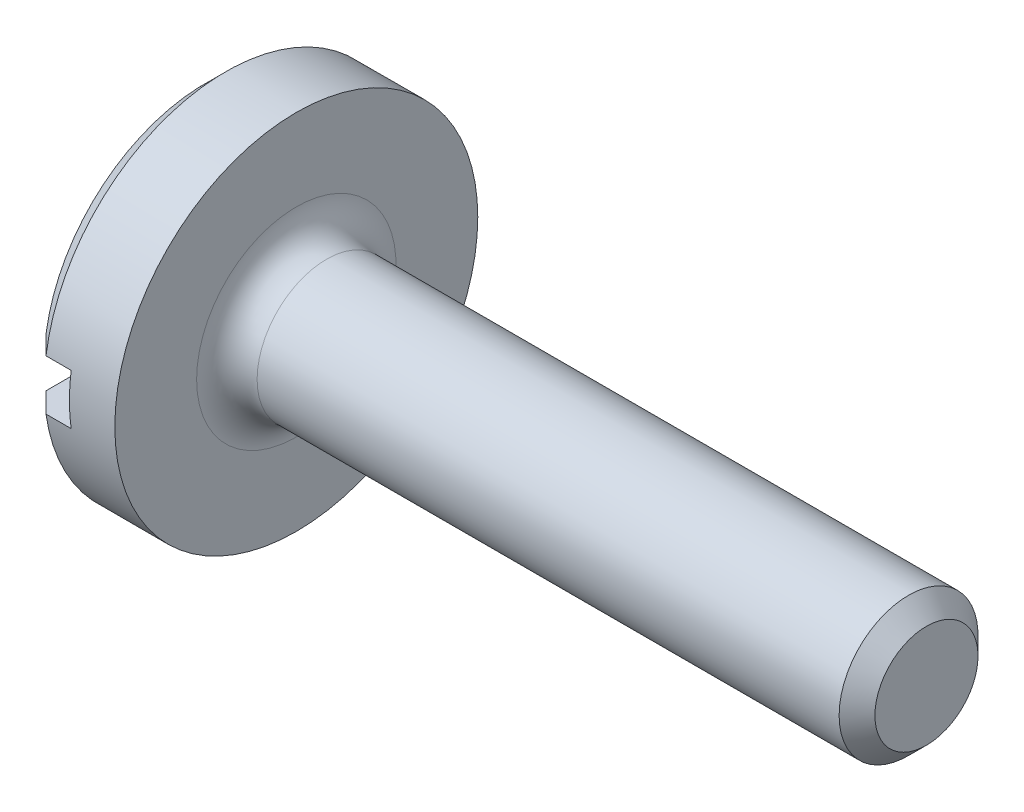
ISO-10303-21;
HEADER;
FILE_DESCRIPTION(('STEP AP214'),'2;1');
FILE_NAME('part.step','',(''),(''),'','','');
FILE_SCHEMA(('AUTOMOTIVE_DESIGN { 1 0 10303 214 1 1 1 1 }'));
ENDSEC;
DATA;
#1=APPLICATION_CONTEXT('core data for automotive mechanical design processes');
#2=APPLICATION_PROTOCOL_DEFINITION('international standard','automotive_design',2000,#1);
#3=PRODUCT_CONTEXT('',#1,'mechanical');
#4=PRODUCT('Part','Part','',(#3));
#5=PRODUCT_RELATED_PRODUCT_CATEGORY('part','',(#4));
#6=PRODUCT_DEFINITION_FORMATION('','',#4);
#7=PRODUCT_DEFINITION_CONTEXT('part definition',#1,'design');
#8=PRODUCT_DEFINITION('design','',#6,#7);
#9=PRODUCT_DEFINITION_SHAPE('','',#8);
#10=(LENGTH_UNIT() NAMED_UNIT(*) SI_UNIT(.MILLI.,.METRE.));
#11=(NAMED_UNIT(*) PLANE_ANGLE_UNIT() SI_UNIT($,.RADIAN.));
#12=(NAMED_UNIT(*) SI_UNIT($,.STERADIAN.) SOLID_ANGLE_UNIT());
#13=UNCERTAINTY_MEASURE_WITH_UNIT(LENGTH_MEASURE(1.E-05),#10,'distance_accuracy_value','');
#14=(GEOMETRIC_REPRESENTATION_CONTEXT(3) GLOBAL_UNCERTAINTY_ASSIGNED_CONTEXT((#13)) GLOBAL_UNIT_ASSIGNED_CONTEXT((#10,
#11,#12)) REPRESENTATION_CONTEXT('',''));
#15=CARTESIAN_POINT('',(0.,0.,0.));
#16=DIRECTION('',(0.,0.,1.));
#17=DIRECTION('',(1.,0.,0.));
#18=AXIS2_PLACEMENT_3D('',#15,#16,#17);
#19=CARTESIAN_POINT('',(-25.4,0.,0.));
#20=DIRECTION('',(-1.,0.,0.));
#21=DIRECTION('',(0.,0.,1.));
#22=AXIS2_PLACEMENT_3D('',#19,#20,#21);
#23=CYLINDRICAL_SURFACE('',#22,1.8288);
#24=CARTESIAN_POINT('',(0.914399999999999,0.,0.));
#25=DIRECTION('',(-1.,0.,0.));
#26=DIRECTION('',(0.,0.,1.));
#27=AXIS2_PLACEMENT_3D('',#24,#25,#26);
#28=CIRCLE('',#27,1.8288);
#29=CARTESIAN_POINT('',(0.914399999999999,0.,1.8288));
#30=VERTEX_POINT('',#29);
#31=EDGE_CURVE('E155',#30,#30,#28,.T.);
#32=ORIENTED_EDGE('',*,*,#31,.T.);
#33=EDGE_LOOP('',(#32));
#34=FACE_BOUND('',#33,.T.);
#35=CARTESIAN_POINT('',(0.203200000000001,0.,0.));
#36=DIRECTION('',(-1.,0.,0.));
#37=DIRECTION('',(0.,0.,1.));
#38=AXIS2_PLACEMENT_3D('',#35,#36,#37);
#39=CIRCLE('',#38,1.8288);
#40=CARTESIAN_POINT('',(0.20320000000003,-0.254,-1.81107521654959));
#41=VERTEX_POINT('',#40);
#42=CARTESIAN_POINT('',(0.203200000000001,-0.254,1.81107521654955));
#43=VERTEX_POINT('',#42);
#44=EDGE_CURVE('E156',#41,#43,#39,.T.);
#45=ORIENTED_EDGE('',*,*,#44,.F.);
#46=DIRECTION('',(-1.,0.,0.));
#47=VECTOR('',#46,1.);
#48=CARTESIAN_POINT('',(-25.4,-0.254,-1.81107521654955));
#49=LINE('',#48,#47);
#50=CARTESIAN_POINT('',(0.457200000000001,-0.254,-1.81107521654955));
#51=VERTEX_POINT('',#50);
#52=EDGE_CURVE('E62',#41,#51,#49,.F.);
#53=ORIENTED_EDGE('',*,*,#52,.T.);
#54=CARTESIAN_POINT('',(0.457200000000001,0.,0.));
#55=DIRECTION('',(-1.,0.,0.));
#56=DIRECTION('',(0.,0.,1.));
#57=AXIS2_PLACEMENT_3D('',#54,#55,#56);
#58=CIRCLE('',#57,1.8288);
#59=CARTESIAN_POINT('',(0.457200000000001,0.254,-1.81107521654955));
#60=VERTEX_POINT('',#59);
#61=EDGE_CURVE('E103',#51,#60,#58,.F.);
#62=ORIENTED_EDGE('',*,*,#61,.T.);
#63=DIRECTION('',(-1.,0.,0.));
#64=VECTOR('',#63,1.);
#65=CARTESIAN_POINT('',(-25.4,0.254,-1.81107521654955));
#66=LINE('',#65,#64);
#67=CARTESIAN_POINT('',(0.203200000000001,0.254,-1.81107521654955));
#68=VERTEX_POINT('',#67);
#69=EDGE_CURVE('E109',#60,#68,#66,.T.);
#70=ORIENTED_EDGE('',*,*,#69,.T.);
#71=CARTESIAN_POINT('',(0.20320000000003,0.254,1.81107521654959));
#72=VERTEX_POINT('',#71);
#73=EDGE_CURVE('E114',#72,#68,#39,.T.);
#74=ORIENTED_EDGE('',*,*,#73,.F.);
#75=DIRECTION('',(-1.,0.,0.));
#76=VECTOR('',#75,1.);
#77=CARTESIAN_POINT('',(-25.4,0.254,1.81107521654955));
#78=LINE('',#77,#76);
#79=CARTESIAN_POINT('',(0.457200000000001,0.254,1.81107521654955));
#80=VERTEX_POINT('',#79);
#81=EDGE_CURVE('E107',#72,#80,#78,.F.);
#82=ORIENTED_EDGE('',*,*,#81,.T.);
#83=CARTESIAN_POINT('',(0.457200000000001,-0.254,1.81107521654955));
#84=VERTEX_POINT('',#83);
#85=EDGE_CURVE('E93',#80,#84,#58,.F.);
#86=ORIENTED_EDGE('',*,*,#85,.T.);
#87=DIRECTION('',(-1.,0.,0.));
#88=VECTOR('',#87,1.);
#89=CARTESIAN_POINT('',(-25.4,-0.254,1.81107521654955));
#90=LINE('',#89,#88);
#91=EDGE_CURVE('E117',#84,#43,#90,.T.);
#92=ORIENTED_EDGE('',*,*,#91,.T.);
#93=EDGE_LOOP('',(#45,#53,#62,#70,#74,#82,#86,#92));
#94=FACE_BOUND('',#93,.T.);
#95=ADVANCED_FACE('F39',(#34,#94),#23,.T.);
#96=CARTESIAN_POINT('',(0.203200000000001,0.,0.));
#97=DIRECTION('',(1.,0.,0.));
#98=DIRECTION('',(0.,0.,-1.));
#99=AXIS2_PLACEMENT_3D('',#96,#97,#98);
#100=CONICAL_SURFACE('',#99,1.8288,0.785398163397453);
#101=CARTESIAN_POINT('',(2.40134405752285,-0.254,-4.01892553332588));
#102=CARTESIAN_POINT('',(2.26411243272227,-0.254,-3.88141790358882));
#103=CARTESIAN_POINT('',(2.12689277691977,-0.254,-3.74389831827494));
#104=CARTESIAN_POINT('',(1.85249047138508,-0.254,-3.46881754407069));
#105=CARTESIAN_POINT('',(1.71530782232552,-0.254,-3.33125635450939));
#106=CARTESIAN_POINT('',(1.44094420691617,-0.254,-3.05602612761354));
#107=CARTESIAN_POINT('',(1.303763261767,-0.254,-2.91835706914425));
#108=CARTESIAN_POINT('',(1.02948630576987,-0.254,-2.64293891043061));
#109=CARTESIAN_POINT('',(0.892390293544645,-0.254,-2.50518981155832));
#110=CARTESIAN_POINT('',(0.615134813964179,-0.254,-2.22634278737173));
#111=CARTESIAN_POINT('',(0.474978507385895,-0.254,-2.08524171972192));
#112=CARTESIAN_POINT('',(0.194901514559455,-0.254,-1.80279178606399));
#113=CARTESIAN_POINT('',(0.0549808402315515,-0.254,-1.66144290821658));
#114=CARTESIAN_POINT('',(-0.154496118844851,-0.254,-1.44905542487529));
#115=CARTESIAN_POINT('',(-0.22424585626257,-0.254,-1.37820765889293));
#116=CARTESIAN_POINT('',(-0.363542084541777,-0.254,-1.23630946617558));
#117=CARTESIAN_POINT('',(-0.433088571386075,-0.254,-1.16525903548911));
#118=CARTESIAN_POINT('',(-0.571828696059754,-0.254,-1.02282736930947));
#119=CARTESIAN_POINT('',(-0.641022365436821,-0.254,-0.951446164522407));
#120=CARTESIAN_POINT('',(-0.778783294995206,-0.254,-0.808082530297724));
#121=CARTESIAN_POINT('',(-0.847350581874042,-0.254,-0.736100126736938));
#122=CARTESIAN_POINT('',(-0.933516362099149,-0.254,-0.643824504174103));
#123=CARTESIAN_POINT('',(-0.951783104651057,-0.254,-0.624157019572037));
#124=CARTESIAN_POINT('',(-0.988170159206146,-0.254,-0.584687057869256));
#125=CARTESIAN_POINT('',(-1.00629046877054,-0.254,-0.56488457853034));
#126=CARTESIAN_POINT('',(-1.0603112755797,-0.254,-0.505296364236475));
#127=CARTESIAN_POINT('',(-1.09593883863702,-0.254,-0.465258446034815));
#128=CARTESIAN_POINT('',(-1.15457051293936,-0.254,-0.396927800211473));
#129=CARTESIAN_POINT('',(-1.17796824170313,-0.254,-0.368973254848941));
#130=CARTESIAN_POINT('',(-1.22365520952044,-0.254,-0.311993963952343));
#131=CARTESIAN_POINT('',(-1.24594060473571,-0.254,-0.282966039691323));
#132=CARTESIAN_POINT('',(-1.2848511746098,-0.254,-0.227850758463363));
#133=CARTESIAN_POINT('',(-1.30181803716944,-0.254,-0.20200616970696));
#134=CARTESIAN_POINT('',(-1.33229183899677,-0.254,-0.148331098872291));
#135=CARTESIAN_POINT('',(-1.34581753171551,-0.254,-0.120512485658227));
#136=CARTESIAN_POINT('',(-1.36086272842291,-0.254,-0.0759914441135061));
#137=CARTESIAN_POINT('',(-1.36503616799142,-0.254,-0.0602332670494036));
#138=CARTESIAN_POINT('',(-1.37051425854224,-0.254,-0.0282568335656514));
#139=CARTESIAN_POINT('',(-1.37183026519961,-0.254,-0.0120406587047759));
#140=CARTESIAN_POINT('',(-1.37130128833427,-0.254,0.020380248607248));
#141=CARTESIAN_POINT('',(-1.36944767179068,-0.254,0.0365848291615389));
#142=CARTESIAN_POINT('',(-1.36300429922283,-0.254,0.0684653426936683));
#143=CARTESIAN_POINT('',(-1.35840438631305,-0.254,0.0841390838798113));
#144=CARTESIAN_POINT('',(-1.34646501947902,-0.254,0.11690192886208));
#145=CARTESIAN_POINT('',(-1.33883071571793,-0.254,0.13387893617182));
#146=CARTESIAN_POINT('',(-1.32194163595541,-0.254,0.167021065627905));
#147=CARTESIAN_POINT('',(-1.31268339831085,-0.254,0.183184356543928));
#148=CARTESIAN_POINT('',(-1.29305944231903,-0.254,0.215000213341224));
#149=CARTESIAN_POINT('',(-1.28268509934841,-0.254,0.230647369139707));
#150=CARTESIAN_POINT('',(-1.26125731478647,-0.254,0.26143930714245));
#151=CARTESIAN_POINT('',(-1.25020459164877,-0.254,0.276584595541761));
#152=CARTESIAN_POINT('',(-1.21381853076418,-0.254,0.324861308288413));
#153=CARTESIAN_POINT('',(-1.18757520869,-0.254,0.357301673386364));
#154=CARTESIAN_POINT('',(-1.13398609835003,-0.254,0.421263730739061));
#155=CARTESIAN_POINT('',(-1.10663971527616,-0.254,0.452784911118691));
#156=CARTESIAN_POINT('',(-1.05126968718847,-0.254,0.51531649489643));
#157=CARTESIAN_POINT('',(-1.02324503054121,-0.254,0.546326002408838));
#158=CARTESIAN_POINT('',(-0.966812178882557,-0.254,0.607977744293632));
#159=CARTESIAN_POINT('',(-0.938404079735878,-0.254,0.638620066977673));
#160=CARTESIAN_POINT('',(-0.853090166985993,-0.254,0.72988285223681));
#161=CARTESIAN_POINT('',(-0.795810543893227,-0.254,0.790153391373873));
#162=CARTESIAN_POINT('',(-0.680808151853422,-0.254,0.910162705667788));
#163=CARTESIAN_POINT('',(-0.623085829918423,-0.254,0.969901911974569));
#164=CARTESIAN_POINT('',(-0.443292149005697,-0.254,1.15510727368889));
#165=CARTESIAN_POINT('',(-0.320740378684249,-0.254,1.28010671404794));
#166=CARTESIAN_POINT('',(-0.0751604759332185,-0.254,1.52963868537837));
#167=CARTESIAN_POINT('',(0.0478676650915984,-0.254,1.65417120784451));
#168=CARTESIAN_POINT('',(0.294233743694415,-0.254,1.90303992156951));
#169=CARTESIAN_POINT('',(0.417571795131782,-0.254,2.02737600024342));
#170=CARTESIAN_POINT('',(0.664390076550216,-0.254,2.27590505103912));
#171=CARTESIAN_POINT('',(0.787870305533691,-0.254,2.40009802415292));
#172=CARTESIAN_POINT('',(1.15954500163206,-0.254,2.77365393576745));
#173=CARTESIAN_POINT('',(1.40787267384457,-0.254000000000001,3.02288435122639));
#174=CARTESIAN_POINT('',(1.78042320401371,-0.254000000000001,3.39655135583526));
#175=CARTESIAN_POINT('',(1.90458661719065,-0.254000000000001,3.52104726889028));
#176=CARTESIAN_POINT('',(2.15294426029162,-0.254000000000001,3.77000773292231));
#177=CARTESIAN_POINT('',(2.27713849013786,-0.254000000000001,3.89447228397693));
#178=CARTESIAN_POINT('',(2.40134405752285,-0.254000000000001,4.01892553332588));
#179=B_SPLINE_CURVE_WITH_KNOTS('',3,(#101,#102,#103,#104,#105,#106,#107,#108,#109,#110,#111,
#112,#113,#114,#115,#116,#117,#118,#119,#120,#121,#122,#123,#124,#125,#126,#127,#128,#129,#130,
#131,#132,#133,#134,#135,#136,#137,#138,#139,#140,#141,#142,#143,#144,#145,#146,#147,#148,#149,
#150,#151,#152,#153,#154,#155,#156,#157,#158,#159,#160,#161,#162,#163,#164,#165,#166,#167,#168,
#169,#170,#171,#172,#173,#174,#175,#176,#177,#178),.UNSPECIFIED.,.F.,.F.,(4,2,2,2,2,2,2,2,2,2,2,
2,2,2,2,2,2,2,2,2,2,2,2,2,2,2,2,2,2,2,2,2,2,2,2,2,2,2,4),(0.,0.58281027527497,1.16563051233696,
1.74867632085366,2.33171241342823,2.92835272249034,3.52502235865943,3.82328364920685,
4.12155079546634,4.41979078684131,4.71801800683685,4.79854261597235,4.87906856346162,
5.03982632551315,5.1491791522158,5.25888686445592,5.35156888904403,5.44373444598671,
5.49243715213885,5.54094595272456,5.58958708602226,5.63840923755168,5.69411617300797,
5.7499433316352,5.80623797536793,5.8624739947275,5.98758936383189,6.1127731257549,
6.23815676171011,6.3635096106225,6.61294438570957,6.86215385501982,7.38730971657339,
7.91247509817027,8.43787512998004,8.96327149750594,10.0187530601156,10.5462396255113,
11.0737248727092),.UNSPECIFIED.);
#180=CARTESIAN_POINT('',(0.,-0.254,-1.60563363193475));
#181=VERTEX_POINT('',#180);
#182=EDGE_CURVE('E119',#41,#181,#179,.T.);
#183=ORIENTED_EDGE('',*,*,#182,.F.);
#184=ORIENTED_EDGE('',*,*,#44,.T.);
#185=CARTESIAN_POINT('',(0.,-0.254,1.60563363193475));
#186=VERTEX_POINT('',#185);
#187=EDGE_CURVE('E115',#186,#43,#179,.T.);
#188=ORIENTED_EDGE('',*,*,#187,.F.);
#189=CARTESIAN_POINT('',(0.,0.,0.));
#190=DIRECTION('',(-1.,0.,0.));
#191=DIRECTION('',(0.,0.,1.));
#192=AXIS2_PLACEMENT_3D('',#189,#190,#191);
#193=CIRCLE('',#192,1.6256);
#194=EDGE_CURVE('E207',#181,#186,#193,.T.);
#195=ORIENTED_EDGE('',*,*,#194,.F.);
#196=EDGE_LOOP('',(#183,#184,#188,#195));
#197=FACE_BOUND('',#196,.T.);
#198=ADVANCED_FACE('F131',(#197),#100,.T.);
#199=CARTESIAN_POINT('',(2.40134405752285,0.254,4.01892553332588));
#200=CARTESIAN_POINT('',(2.26411243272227,0.254,3.88141790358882));
#201=CARTESIAN_POINT('',(2.12689277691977,0.254,3.74389831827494));
#202=CARTESIAN_POINT('',(1.85249047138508,0.254,3.46881754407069));
#203=CARTESIAN_POINT('',(1.71530782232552,0.254,3.33125635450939));
#204=CARTESIAN_POINT('',(1.44094420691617,0.254,3.05602612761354));
#205=CARTESIAN_POINT('',(1.303763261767,0.254,2.91835706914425));
#206=CARTESIAN_POINT('',(1.02948630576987,0.254,2.64293891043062));
#207=CARTESIAN_POINT('',(0.892390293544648,0.254,2.50518981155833));
#208=CARTESIAN_POINT('',(0.615134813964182,0.254,2.22634278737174));
#209=CARTESIAN_POINT('',(0.474978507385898,0.254,2.08524171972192));
#210=CARTESIAN_POINT('',(0.194901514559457,0.254,1.802791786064));
#211=CARTESIAN_POINT('',(0.0549808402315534,0.254,1.66144290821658));
#212=CARTESIAN_POINT('',(-0.154496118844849,0.254,1.44905542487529));
#213=CARTESIAN_POINT('',(-0.224245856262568,0.254,1.37820765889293));
#214=CARTESIAN_POINT('',(-0.363542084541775,0.254,1.23630946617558));
#215=CARTESIAN_POINT('',(-0.433088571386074,0.254,1.16525903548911));
#216=CARTESIAN_POINT('',(-0.571828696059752,0.254,1.02282736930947));
#217=CARTESIAN_POINT('',(-0.641022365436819,0.254,0.951446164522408));
#218=CARTESIAN_POINT('',(-0.778783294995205,0.254,0.808082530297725));
#219=CARTESIAN_POINT('',(-0.847350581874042,0.254,0.73610012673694));
#220=CARTESIAN_POINT('',(-0.933516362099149,0.254,0.643824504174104));
#221=CARTESIAN_POINT('',(-0.951783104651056,0.254,0.624157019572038));
#222=CARTESIAN_POINT('',(-0.988170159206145,0.254,0.584687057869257));
#223=CARTESIAN_POINT('',(-1.00629046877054,0.254,0.564884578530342));
#224=CARTESIAN_POINT('',(-1.0603112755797,0.254,0.505296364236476));
#225=CARTESIAN_POINT('',(-1.09593883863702,0.254,0.465258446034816));
#226=CARTESIAN_POINT('',(-1.15457051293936,0.254,0.396927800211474));
#227=CARTESIAN_POINT('',(-1.17796824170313,0.254,0.368973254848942));
#228=CARTESIAN_POINT('',(-1.22365520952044,0.254,0.311993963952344));
#229=CARTESIAN_POINT('',(-1.24594060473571,0.254,0.282966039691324));
#230=CARTESIAN_POINT('',(-1.2848511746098,0.254,0.227850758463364));
#231=CARTESIAN_POINT('',(-1.30181803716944,0.254,0.202006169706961));
#232=CARTESIAN_POINT('',(-1.33229183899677,0.254,0.148331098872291));
#233=CARTESIAN_POINT('',(-1.34581753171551,0.254,0.120512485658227));
#234=CARTESIAN_POINT('',(-1.36086272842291,0.254,0.0759914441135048));
#235=CARTESIAN_POINT('',(-1.36503616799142,0.254,0.0602332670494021));
#236=CARTESIAN_POINT('',(-1.37051425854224,0.254,0.0282568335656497));
#237=CARTESIAN_POINT('',(-1.37183026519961,0.254,0.0120406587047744));
#238=CARTESIAN_POINT('',(-1.37130128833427,0.254,-0.0203802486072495));
#239=CARTESIAN_POINT('',(-1.36944767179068,0.254,-0.0365848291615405));
#240=CARTESIAN_POINT('',(-1.36300429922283,0.254,-0.0684653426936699));
#241=CARTESIAN_POINT('',(-1.35840438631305,0.254,-0.084139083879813));
#242=CARTESIAN_POINT('',(-1.34646501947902,0.254,-0.116901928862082));
#243=CARTESIAN_POINT('',(-1.33883071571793,0.254,-0.133878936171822));
#244=CARTESIAN_POINT('',(-1.32194163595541,0.254,-0.167021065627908));
#245=CARTESIAN_POINT('',(-1.31268339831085,0.254,-0.183184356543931));
#246=CARTESIAN_POINT('',(-1.29305944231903,0.254,-0.215000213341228));
#247=CARTESIAN_POINT('',(-1.2826850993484,0.254,-0.230647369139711));
#248=CARTESIAN_POINT('',(-1.26125731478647,0.254,-0.261439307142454));
#249=CARTESIAN_POINT('',(-1.25020459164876,0.254,-0.276584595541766));
#250=CARTESIAN_POINT('',(-1.21381853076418,0.254,-0.324861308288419));
#251=CARTESIAN_POINT('',(-1.18757520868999,0.254,-0.35730167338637));
#252=CARTESIAN_POINT('',(-1.13398609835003,0.254,-0.421263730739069));
#253=CARTESIAN_POINT('',(-1.10663971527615,0.254,-0.452784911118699));
#254=CARTESIAN_POINT('',(-1.05126968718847,0.254,-0.51531649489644));
#255=CARTESIAN_POINT('',(-1.0232450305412,0.254,-0.546326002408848));
#256=CARTESIAN_POINT('',(-0.966812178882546,0.254,-0.607977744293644));
#257=CARTESIAN_POINT('',(-0.938404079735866,0.254,-0.638620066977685));
#258=CARTESIAN_POINT('',(-0.853090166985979,0.254,-0.729882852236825));
#259=CARTESIAN_POINT('',(-0.795810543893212,0.254,-0.790153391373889));
#260=CARTESIAN_POINT('',(-0.680808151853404,0.254,-0.910162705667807));
#261=CARTESIAN_POINT('',(-0.623085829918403,0.254,-0.96990191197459));
#262=CARTESIAN_POINT('',(-0.443292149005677,0.254,-1.15510727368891));
#263=CARTESIAN_POINT('',(-0.32074037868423,0.254,-1.28010671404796));
#264=CARTESIAN_POINT('',(-0.0751604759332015,0.254,-1.52963868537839));
#265=CARTESIAN_POINT('',(0.0478676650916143,0.254,-1.65417120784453));
#266=CARTESIAN_POINT('',(0.294233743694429,0.254,-1.90303992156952));
#267=CARTESIAN_POINT('',(0.417571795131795,0.254,-2.02737600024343));
#268=CARTESIAN_POINT('',(0.664390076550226,0.254,-2.27590505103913));
#269=CARTESIAN_POINT('',(0.7878703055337,0.254,-2.40009802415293));
#270=CARTESIAN_POINT('',(1.15954500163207,0.254,-2.77365393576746));
#271=CARTESIAN_POINT('',(1.40787267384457,0.254,-3.0228843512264));
#272=CARTESIAN_POINT('',(1.78042320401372,0.254,-3.39655135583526));
#273=CARTESIAN_POINT('',(1.90458661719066,0.254,-3.52104726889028));
#274=CARTESIAN_POINT('',(2.15294426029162,0.254,-3.77000773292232));
#275=CARTESIAN_POINT('',(2.27713849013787,0.254,-3.89447228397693));
#276=CARTESIAN_POINT('',(2.40134405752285,0.254,-4.01892553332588));
#277=B_SPLINE_CURVE_WITH_KNOTS('',3,(#199,#200,#201,#202,#203,#204,#205,#206,#207,#208,#209,
#210,#211,#212,#213,#214,#215,#216,#217,#218,#219,#220,#221,#222,#223,#224,#225,#226,#227,#228,
#229,#230,#231,#232,#233,#234,#235,#236,#237,#238,#239,#240,#241,#242,#243,#244,#245,#246,#247,
#248,#249,#250,#251,#252,#253,#254,#255,#256,#257,#258,#259,#260,#261,#262,#263,#264,#265,#266,
#267,#268,#269,#270,#271,#272,#273,#274,#275,#276),.UNSPECIFIED.,.F.,.F.,(4,2,2,2,2,2,2,2,2,2,2,
2,2,2,2,2,2,2,2,2,2,2,2,2,2,2,2,2,2,2,2,2,2,2,2,2,2,2,4),(0.,0.582810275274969,1.16563051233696,
1.74867632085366,2.33171241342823,2.92835272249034,3.52502235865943,3.82328364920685,
4.12155079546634,4.41979078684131,4.71801800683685,4.79854261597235,4.87906856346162,
5.03982632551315,5.1491791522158,5.25888686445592,5.35156888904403,5.44373444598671,
5.49243715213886,5.54094595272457,5.58958708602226,5.63840923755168,5.69411617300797,
5.74994333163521,5.80623797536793,5.8624739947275,5.9875893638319,6.11277312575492,
6.23815676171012,6.36350961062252,6.6129443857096,6.86215385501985,7.38730971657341,
7.9124750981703,8.43787512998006,8.96327149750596,10.0187530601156,10.5462396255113,
11.0737248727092),.UNSPECIFIED.);
#278=CARTESIAN_POINT('',(0.,0.254,1.60563363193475));
#279=VERTEX_POINT('',#278);
#280=EDGE_CURVE('E54',#72,#279,#277,.T.);
#281=ORIENTED_EDGE('',*,*,#280,.F.);
#282=ORIENTED_EDGE('',*,*,#73,.T.);
#283=CARTESIAN_POINT('',(0.,0.254,-1.60563363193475));
#284=VERTEX_POINT('',#283);
#285=EDGE_CURVE('E121',#284,#68,#277,.T.);
#286=ORIENTED_EDGE('',*,*,#285,.F.);
#287=EDGE_CURVE('E162',#279,#284,#193,.T.);
#288=ORIENTED_EDGE('',*,*,#287,.F.);
#289=EDGE_LOOP('',(#281,#282,#286,#288));
#290=FACE_BOUND('',#289,.T.);
#291=ADVANCED_FACE('F152',(#290),#100,.T.);
#292=CARTESIAN_POINT('',(0.,0.,0.));
#293=DIRECTION('',(-1.,0.,0.));
#294=DIRECTION('',(0.,0.,1.));
#295=AXIS2_PLACEMENT_3D('',#292,#293,#294);
#296=PLANE('',#295);
#297=ORIENTED_EDGE('',*,*,#194,.T.);
#298=DIRECTION('',(0.,0.,-1.));
#299=VECTOR('',#298,1.);
#300=CARTESIAN_POINT('',(0.,-0.254,0.));
#301=LINE('',#300,#299);
#302=EDGE_CURVE('E104',#186,#181,#301,.T.);
#303=ORIENTED_EDGE('',*,*,#302,.T.);
#304=EDGE_LOOP('',(#297,#303));
#305=FACE_BOUND('',#304,.T.);
#306=ADVANCED_FACE('F197',(#305),#296,.T.);
#307=ORIENTED_EDGE('',*,*,#287,.T.);
#308=DIRECTION('',(0.,0.,1.));
#309=VECTOR('',#308,1.);
#310=CARTESIAN_POINT('',(0.,0.254,0.));
#311=LINE('',#310,#309);
#312=EDGE_CURVE('E159',#284,#279,#311,.T.);
#313=ORIENTED_EDGE('',*,*,#312,.T.);
#314=EDGE_LOOP('',(#307,#313));
#315=FACE_BOUND('',#314,.T.);
#316=ADVANCED_FACE('F192',(#315),#296,.T.);
#317=CARTESIAN_POINT('',(-25.4,0.,0.));
#318=DIRECTION('',(-1.,0.,0.));
#319=DIRECTION('',(0.,0.,1.));
#320=AXIS2_PLACEMENT_3D('',#317,#318,#319);
#321=CYLINDRICAL_SURFACE('',#320,0.69977);
#322=CARTESIAN_POINT('',(1.2192,0.,0.));
#323=DIRECTION('',(-1.,0.,0.));
#324=DIRECTION('',(0.,0.,1.));
#325=AXIS2_PLACEMENT_3D('',#322,#323,#324);
#326=CIRCLE('',#325,0.69977);
#327=CARTESIAN_POINT('',(1.2192,0.,0.69977));
#328=VERTEX_POINT('',#327);
#329=EDGE_CURVE('E11',#328,#328,#326,.F.);
#330=ORIENTED_EDGE('',*,*,#329,.T.);
#331=EDGE_LOOP('',(#330));
#332=FACE_BOUND('',#331,.T.);
#333=CARTESIAN_POINT('',(7.08406,0.,0.));
#334=DIRECTION('',(-1.,0.,0.));
#335=DIRECTION('',(0.,0.,1.));
#336=AXIS2_PLACEMENT_3D('',#333,#334,#335);
#337=CIRCLE('',#336,0.69977);
#338=CARTESIAN_POINT('',(7.08406,0.,0.69977));
#339=VERTEX_POINT('',#338);
#340=EDGE_CURVE('E202',#339,#339,#337,.T.);
#341=ORIENTED_EDGE('',*,*,#340,.T.);
#342=EDGE_LOOP('',(#341));
#343=FACE_BOUND('',#342,.T.);
#344=ADVANCED_FACE('F190',(#332,#343),#321,.T.);
#345=CARTESIAN_POINT('',(0.9144,0.69977,0.));
#346=DIRECTION('',(-1.,0.,0.));
#347=DIRECTION('',(0.,0.,1.));
#348=AXIS2_PLACEMENT_3D('',#345,#346,#347);
#349=PLANE('',#348);
#350=CARTESIAN_POINT('',(0.9144,0.,0.));
#351=DIRECTION('',(-1.,0.,0.));
#352=DIRECTION('',(0.,0.,1.));
#353=AXIS2_PLACEMENT_3D('',#350,#351,#352);
#354=CIRCLE('',#353,1.00457);
#355=CARTESIAN_POINT('',(0.9144,0.,1.00457));
#356=VERTEX_POINT('',#355);
#357=EDGE_CURVE('E47',#356,#356,#354,.T.);
#358=ORIENTED_EDGE('',*,*,#357,.T.);
#359=EDGE_LOOP('',(#358));
#360=FACE_BOUND('',#359,.T.);
#361=ORIENTED_EDGE('',*,*,#31,.F.);
#362=EDGE_LOOP('',(#361));
#363=FACE_BOUND('',#362,.T.);
#364=ADVANCED_FACE('F171',(#360,#363),#349,.F.);
#365=CARTESIAN_POINT('',(7.2644,0.51943,0.));
#366=DIRECTION('',(1.,0.,0.));
#367=DIRECTION('',(0.,0.,-1.));
#368=AXIS2_PLACEMENT_3D('',#365,#366,#367);
#369=PLANE('',#368);
#370=CARTESIAN_POINT('',(7.2644,0.,0.));
#371=DIRECTION('',(-1.,0.,0.));
#372=DIRECTION('',(0.,0.,1.));
#373=AXIS2_PLACEMENT_3D('',#370,#371,#372);
#374=CIRCLE('',#373,0.51943);
#375=CARTESIAN_POINT('',(7.2644,0.,0.51943));
#376=VERTEX_POINT('',#375);
#377=EDGE_CURVE('E204',#376,#376,#374,.T.);
#378=ORIENTED_EDGE('',*,*,#377,.F.);
#379=EDGE_LOOP('',(#378));
#380=FACE_BOUND('',#379,.T.);
#381=ADVANCED_FACE('F189',(#380),#369,.T.);
#382=CARTESIAN_POINT('',(7.08406,0.,0.));
#383=DIRECTION('',(-1.,0.,0.));
#384=DIRECTION('',(0.,0.,1.));
#385=AXIS2_PLACEMENT_3D('',#382,#383,#384);
#386=CONICAL_SURFACE('',#385,0.69977,0.785398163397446);
#387=ORIENTED_EDGE('',*,*,#377,.T.);
#388=EDGE_LOOP('',(#387));
#389=FACE_BOUND('',#388,.T.);
#390=ORIENTED_EDGE('',*,*,#340,.F.);
#391=EDGE_LOOP('',(#390));
#392=FACE_BOUND('',#391,.T.);
#393=ADVANCED_FACE('F140',(#389,#392),#386,.T.);
#394=CARTESIAN_POINT('',(0.,-0.254,-1.8288));
#395=DIRECTION('',(0.,1.,0.));
#396=DIRECTION('',(0.,0.,1.));
#397=AXIS2_PLACEMENT_3D('',#394,#395,#396);
#398=PLANE('',#397);
#399=ORIENTED_EDGE('',*,*,#182,.T.);
#400=ORIENTED_EDGE('',*,*,#302,.F.);
#401=ORIENTED_EDGE('',*,*,#187,.T.);
#402=ORIENTED_EDGE('',*,*,#91,.F.);
#403=DIRECTION('',(0.,0.,1.));
#404=VECTOR('',#403,1.);
#405=CARTESIAN_POINT('',(0.4572,-0.254,-1.8288));
#406=LINE('',#405,#404);
#407=EDGE_CURVE('E98',#51,#84,#406,.T.);
#408=ORIENTED_EDGE('',*,*,#407,.F.);
#409=ORIENTED_EDGE('',*,*,#52,.F.);
#410=EDGE_LOOP('',(#399,#400,#401,#402,#408,#409));
#411=FACE_BOUND('',#410,.T.);
#412=ADVANCED_FACE('F135',(#411),#398,.T.);
#413=CARTESIAN_POINT('',(0.,0.254,1.8288));
#414=DIRECTION('',(0.,-1.,0.));
#415=DIRECTION('',(0.,0.,-1.));
#416=AXIS2_PLACEMENT_3D('',#413,#414,#415);
#417=PLANE('',#416);
#418=ORIENTED_EDGE('',*,*,#280,.T.);
#419=ORIENTED_EDGE('',*,*,#312,.F.);
#420=ORIENTED_EDGE('',*,*,#285,.T.);
#421=ORIENTED_EDGE('',*,*,#69,.F.);
#422=DIRECTION('',(0.,0.,-1.));
#423=VECTOR('',#422,1.);
#424=CARTESIAN_POINT('',(0.4572,0.254,1.8288));
#425=LINE('',#424,#423);
#426=EDGE_CURVE('E96',#80,#60,#425,.T.);
#427=ORIENTED_EDGE('',*,*,#426,.F.);
#428=ORIENTED_EDGE('',*,*,#81,.F.);
#429=EDGE_LOOP('',(#418,#419,#420,#421,#427,#428));
#430=FACE_BOUND('',#429,.T.);
#431=ADVANCED_FACE('F106',(#430),#417,.T.);
#432=CARTESIAN_POINT('',(0.4572,0.254,-1.8288));
#433=DIRECTION('',(-1.,0.,0.));
#434=DIRECTION('',(0.,0.,1.));
#435=AXIS2_PLACEMENT_3D('',#432,#433,#434);
#436=PLANE('',#435);
#437=ORIENTED_EDGE('',*,*,#407,.T.);
#438=ORIENTED_EDGE('',*,*,#85,.F.);
#439=ORIENTED_EDGE('',*,*,#426,.T.);
#440=ORIENTED_EDGE('',*,*,#61,.F.);
#441=EDGE_LOOP('',(#437,#438,#439,#440));
#442=FACE_BOUND('',#441,.T.);
#443=ADVANCED_FACE('F95',(#442),#436,.T.);
#444=CARTESIAN_POINT('',(1.2192,0.,0.));
#445=DIRECTION('',(-1.,0.,0.));
#446=DIRECTION('',(0.,0.,1.));
#447=AXIS2_PLACEMENT_3D('',#444,#445,#446);
#448=TOROIDAL_SURFACE('',#447,1.00457,0.3048);
#449=ORIENTED_EDGE('',*,*,#329,.F.);
#450=EDGE_LOOP('',(#449));
#451=FACE_BOUND('',#450,.T.);
#452=ORIENTED_EDGE('',*,*,#357,.F.);
#453=EDGE_LOOP('',(#452));
#454=FACE_BOUND('',#453,.T.);
#455=ADVANCED_FACE('F41',(#451,#454),#448,.F.);
#456=CLOSED_SHELL('',(#95,#198,#291,#306,#316,#344,#364,#381,#393,#412,#431,#443,#455));
#457=MANIFOLD_SOLID_BREP('B2',#456);
#458=ADVANCED_BREP_SHAPE_REPRESENTATION('',(#18,#457),#14);
#459=SHAPE_DEFINITION_REPRESENTATION(#9,#458);
ENDSEC;
END-ISO-10303-21;
